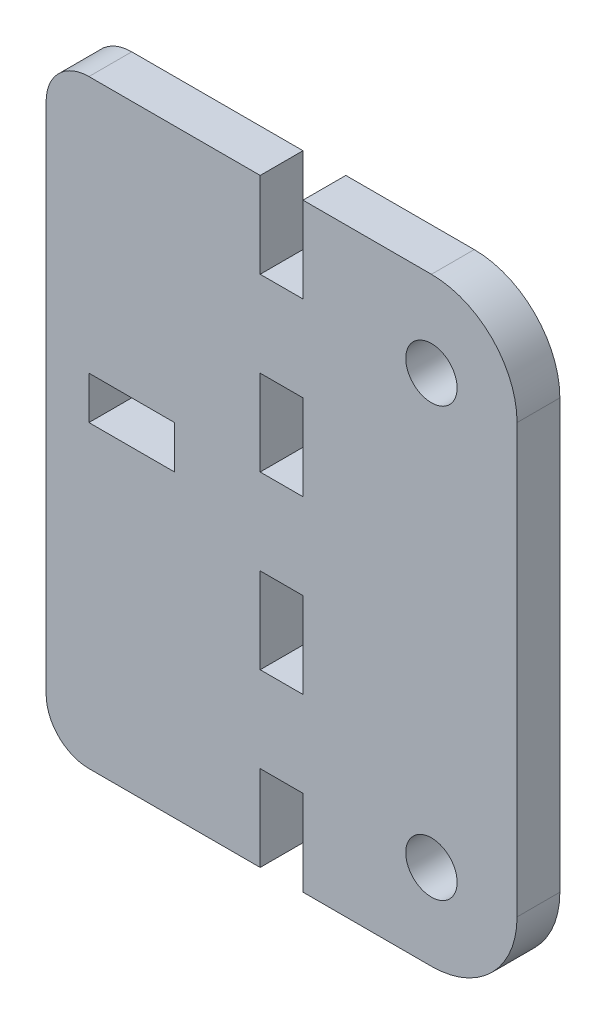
from build123d import *

# Parameters (mm, degrees)
ESQUISSE1_W             = 30
ESQUISSE1_H             = 70
BOSS_EXTRU_1_DEPTH      = 5
ESQUISSE2_W             = 10
ESQUISSE2_H             = 5
ENL_V_MAT_EXTRU_1_DEPTH = 5
ESQUISSE3_W             = 5
ESQUISSE3_H             = 10
ENL_V_MAT_EXTRU_2_DEPTH = 10
ESQUISSE4_W             = 5
ESQUISSE4_H             = 70
BOSS_EXTRU_2_DEPTH      = 25
ESQUISSE5_R             = 3
ENL_V_MAT_EXTRU_3_DEPTH = 5
CONG_1_R                = 10
CONG_2_R                = 5


with BuildPart() as part:
    # Esquisse1 → Boss.-Extru.1 (new body)
    with BuildSketch(Plane.XY):
        with Locations((-15, 0)):
            Rectangle(ESQUISSE1_W, ESQUISSE1_H)
    extrude(amount=BOSS_EXTRU_1_DEPTH)

    # Esquisse2 → Enl_v. mat.-Extru.1 (cut)
    with BuildSketch(Plane.XY.offset(5)):
        with Locations((-20, 2.5)):
            Rectangle(ESQUISSE2_W, ESQUISSE2_H)
    extrude(amount=-ENL_V_MAT_EXTRU_1_DEPTH, mode=Mode.SUBTRACT)

    # Esquisse3 → Enl_v. mat.-Extru.2 (cut)
    with BuildSketch(Plane.XY.offset(5)):
        with Locations((-2.5, -30)):
            Rectangle(ESQUISSE3_W, ESQUISSE3_H)
        with Locations((-2.5, -10)):
            Rectangle(ESQUISSE3_W, ESQUISSE3_H)
        with Locations((-2.5, 10)):
            Rectangle(ESQUISSE3_W, ESQUISSE3_H)
        with Locations((-2.5, 30)):
            Rectangle(ESQUISSE3_W, ESQUISSE3_H)
    extrude(amount=-ENL_V_MAT_EXTRU_2_DEPTH, mode=Mode.SUBTRACT)

    # Esquisse4 → Boss.-Extru.2 (add)
    with BuildSketch(Plane(origin=(0, 0, 0), x_dir=(0, 0, -1), z_dir=(1, 0, 0))):
        with Locations((-2.5, 0)):
            Rectangle(ESQUISSE4_W, ESQUISSE4_H)
    extrude(amount=BOSS_EXTRU_2_DEPTH)

    # Esquisse5 → Enl_v. mat.-Extru.3 (cut)
    with BuildSketch(Plane.XY.offset(5)):
        with Locations((15, 25)):
            Circle(ESQUISSE5_R)
        with Locations((15, -25)):
            Circle(ESQUISSE5_R)
    extrude(amount=-ENL_V_MAT_EXTRU_3_DEPTH, mode=Mode.SUBTRACT)

    # Cong_1
    cong_1_edges = [part.edges().sort_by_distance(p)[0] for p in [
        (25, -35, 2.5),
        (25, 35, 2.5),
    ]]
    fillet(cong_1_edges, radius=CONG_1_R)

    # Cong_2
    cong_2_edges = [part.edges().sort_by_distance(p)[0] for p in [
        (-30, -35, 2.5),
        (-30, 35, 2.5),
    ]]
    fillet(cong_2_edges, radius=CONG_2_R)


solid = part.part
